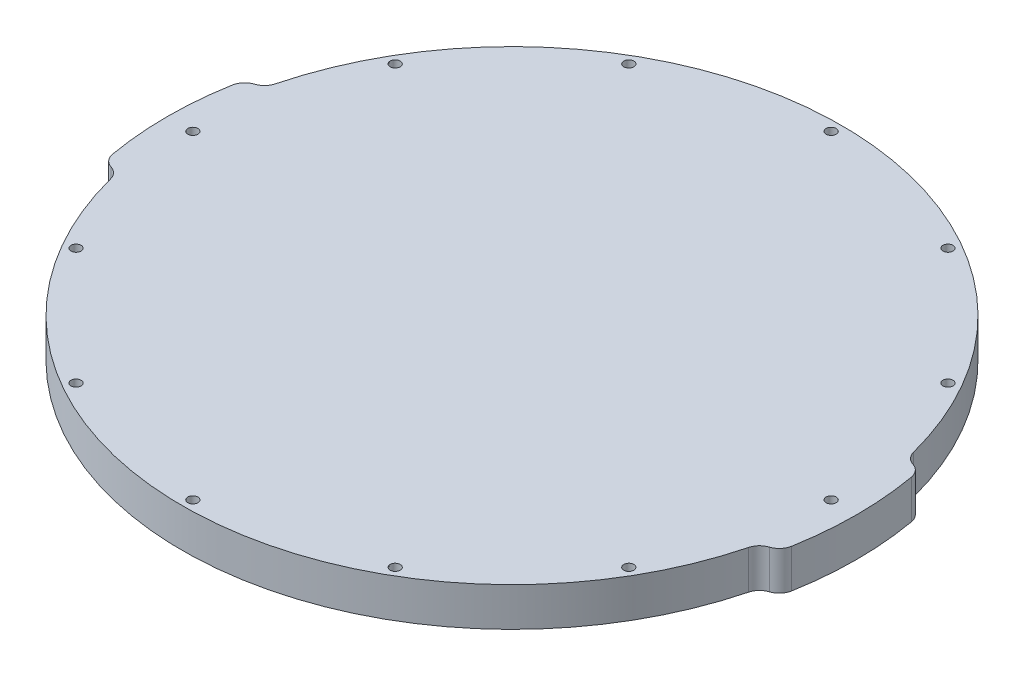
from build123d import *

# Parameters (mm, degrees)
SKETCH1_R           = 1.65
BOSS_EXTRUDE1_DEPTH = 12.7
FILLET1_R           = 5


with BuildPart() as part:
    # Sketch1 → Boss-Extrude1 (new body)
    with BuildSketch(Plane(origin=(0, 0, 0), x_dir=(1, 0, 0), z_dir=(0, 1, 0))):
        with BuildLine():
            ThreePointArc((-111.234035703, -19.613561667), (-112.95, 0), (-111.234035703, 19.613561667))
            ThreePointArc((-111.234035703, 19.613561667), (-109.13025705, 22.87401705), (-105.327953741, 23.647931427))
            ThreePointArc((-105.327953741, 23.647931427), (0, 107.95), (105.327953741, 23.647931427))
            ThreePointArc((105.327953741, 23.647931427), (109.13025705, 22.87401705), (111.234035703, 19.613561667))
            ThreePointArc((111.234035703, 19.613561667), (112.95, 0), (111.234035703, -19.613561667))
            ThreePointArc((111.234035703, -19.613561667), (109.13025705, -22.87401705), (105.327953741, -23.647931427))
            ThreePointArc((105.327953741, -23.647931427), (0, -107.95), (-105.327953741, -23.647931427))
            ThreePointArc((-105.327953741, -23.647931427), (-109.13025705, -22.87401705), (-111.234035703, -19.613561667))
        make_face()
        with Locations(Location((0, 104.55, 0), (0, 0, 270))):
            Circle(SKETCH1_R, mode=Mode.SUBTRACT)
        with Locations(Location((52.275, 90.542955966, 0), (0, 0, 270))):
            Circle(SKETCH1_R, mode=Mode.SUBTRACT)
        with Locations(Location((90.542955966, 52.275, 0), (0, 0, 270))):
            Circle(SKETCH1_R, mode=Mode.SUBTRACT)
        with Locations(Location((104.55, 0, 0), (0, 0, 270))):
            Circle(SKETCH1_R, mode=Mode.SUBTRACT)
        with Locations(Location((90.542955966, -52.275, 0), (0, 0, 270))):
            Circle(SKETCH1_R, mode=Mode.SUBTRACT)
        with Locations(Location((52.275, -90.542955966, 0), (0, 0, 270))):
            Circle(SKETCH1_R, mode=Mode.SUBTRACT)
        with Locations(Location((0, -104.55, 0), (0, 0, 270))):
            Circle(SKETCH1_R, mode=Mode.SUBTRACT)
        with Locations(Location((-52.275, -90.542955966, 0), (0, 0, 270))):
            Circle(SKETCH1_R, mode=Mode.SUBTRACT)
        with Locations(Location((-90.542955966, -52.275, 0), (0, 0, 270))):
            Circle(SKETCH1_R, mode=Mode.SUBTRACT)
        with Locations(Location((-104.55, 0, 0), (0, 0, 270))):
            Circle(SKETCH1_R, mode=Mode.SUBTRACT)
        with Locations(Location((-90.542955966, 52.275, 0), (0, 0, 270))):
            Circle(SKETCH1_R, mode=Mode.SUBTRACT)
        with Locations(Location((-52.275, 90.542955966, 0), (0, 0, 270))):
            Circle(SKETCH1_R, mode=Mode.SUBTRACT)
    extrude(amount=BOSS_EXTRUDE1_DEPTH)

    # Fillet1
    fillet1_edges = [part.edges().sort_by_distance(p)[0] for p in [
        (-105.327953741, 6.35, -23.647931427),
        (105.327953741, 6.35, -23.647931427),
        (105.327953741, 6.35, 23.647931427),
        (-105.327953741, 6.35, 23.647931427),
    ]]
    fillet(fillet1_edges, radius=FILLET1_R)


solid = part.part
